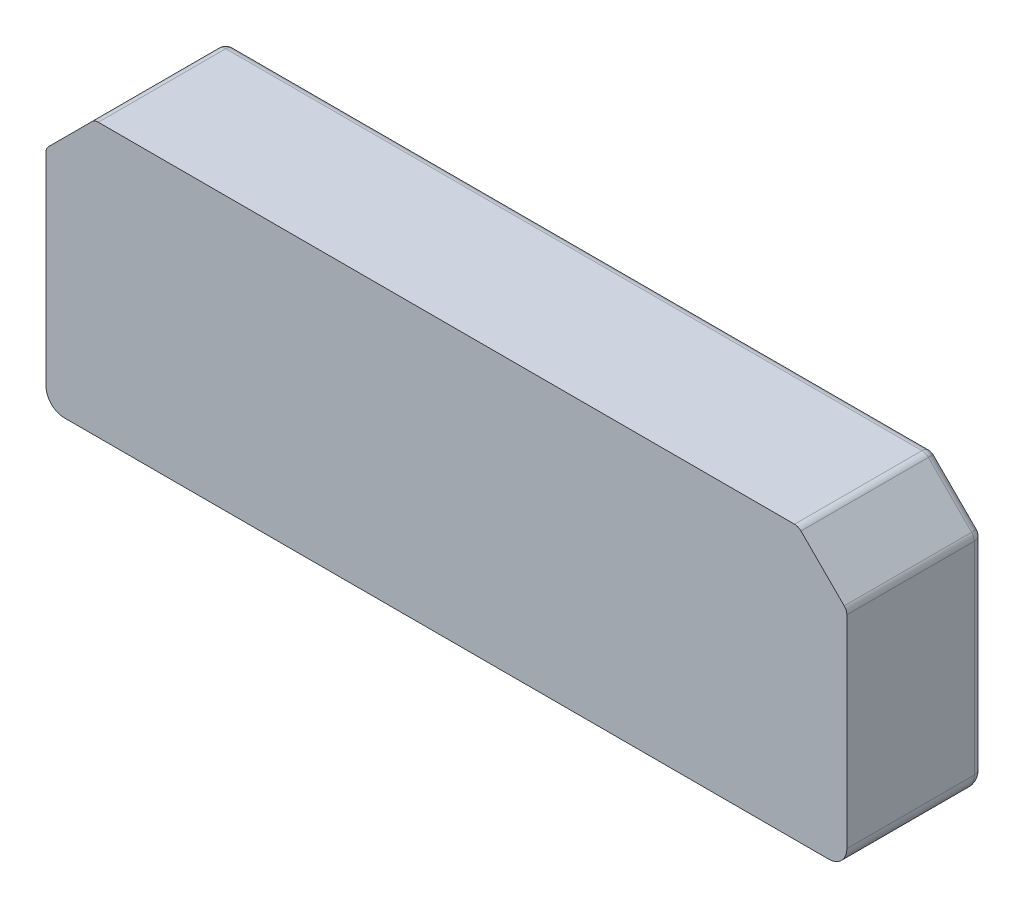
ISO-10303-21;
HEADER;
FILE_DESCRIPTION(('STEP AP214'),'2;1');
FILE_NAME('part.step','',(''),(''),'','','');
FILE_SCHEMA(('AUTOMOTIVE_DESIGN { 1 0 10303 214 1 1 1 1 }'));
ENDSEC;
DATA;
#1=APPLICATION_CONTEXT('core data for automotive mechanical design processes');
#2=APPLICATION_PROTOCOL_DEFINITION('international standard','automotive_design',2000,#1);
#3=PRODUCT_CONTEXT('',#1,'mechanical');
#4=PRODUCT('Part','Part','',(#3));
#5=PRODUCT_RELATED_PRODUCT_CATEGORY('part','',(#4));
#6=PRODUCT_DEFINITION_FORMATION('','',#4);
#7=PRODUCT_DEFINITION_CONTEXT('part definition',#1,'design');
#8=PRODUCT_DEFINITION('design','',#6,#7);
#9=PRODUCT_DEFINITION_SHAPE('','',#8);
#10=(LENGTH_UNIT() NAMED_UNIT(*) SI_UNIT(.MILLI.,.METRE.));
#11=(NAMED_UNIT(*) PLANE_ANGLE_UNIT() SI_UNIT($,.RADIAN.));
#12=(NAMED_UNIT(*) SI_UNIT($,.STERADIAN.) SOLID_ANGLE_UNIT());
#13=UNCERTAINTY_MEASURE_WITH_UNIT(LENGTH_MEASURE(1.E-05),#10,'distance_accuracy_value','');
#14=(GEOMETRIC_REPRESENTATION_CONTEXT(3) GLOBAL_UNCERTAINTY_ASSIGNED_CONTEXT((#13)) GLOBAL_UNIT_ASSIGNED_CONTEXT((#10,
#11,#12)) REPRESENTATION_CONTEXT('',''));
#15=CARTESIAN_POINT('',(0.,0.,0.));
#16=DIRECTION('',(0.,0.,1.));
#17=DIRECTION('',(1.,0.,0.));
#18=AXIS2_PLACEMENT_3D('',#15,#16,#17);
#19=CARTESIAN_POINT('',(-126.000000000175,6.,45.));
#20=DIRECTION('',(0.,0.,-1.));
#21=DIRECTION('',(-1.,0.,0.));
#22=AXIS2_PLACEMENT_3D('',#19,#20,#21);
#23=CYLINDRICAL_SURFACE('',#22,6.);
#24=DIRECTION('',(0.,0.,-1.));
#25=VECTOR('',#24,1.);
#26=CARTESIAN_POINT('',(-132.000000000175,6.,45.));
#27=LINE('',#26,#25);
#28=CARTESIAN_POINT('',(-132.000000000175,6.,45.));
#29=VERTEX_POINT('',#28);
#30=CARTESIAN_POINT('',(-132.000000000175,6.,3.));
#31=VERTEX_POINT('',#30);
#32=EDGE_CURVE('E276',#29,#31,#27,.T.);
#33=ORIENTED_EDGE('',*,*,#32,.T.);
#34=CARTESIAN_POINT('',(-126.000000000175,6.,2.99999999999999));
#35=DIRECTION('',(0.,0.,1.));
#36=DIRECTION('',(1.,0.,0.));
#37=AXIS2_PLACEMENT_3D('',#34,#35,#36);
#38=CIRCLE('',#37,6.);
#39=CARTESIAN_POINT('',(-125.999999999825,0.,3.));
#40=VERTEX_POINT('',#39);
#41=EDGE_CURVE('E11',#31,#40,#38,.T.);
#42=ORIENTED_EDGE('',*,*,#41,.T.);
#43=DIRECTION('',(0.,0.,-1.));
#44=VECTOR('',#43,1.);
#45=CARTESIAN_POINT('',(-125.999999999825,0.,45.));
#46=LINE('',#45,#44);
#47=CARTESIAN_POINT('',(-125.999999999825,0.,45.));
#48=VERTEX_POINT('',#47);
#49=EDGE_CURVE('E156',#48,#40,#46,.T.);
#50=ORIENTED_EDGE('',*,*,#49,.F.);
#51=CARTESIAN_POINT('',(-126.000000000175,6.,45.));
#52=DIRECTION('',(0.,0.,1.));
#53=DIRECTION('',(1.,0.,0.));
#54=AXIS2_PLACEMENT_3D('',#51,#52,#53);
#55=CIRCLE('',#54,6.);
#56=EDGE_CURVE('E163',#29,#48,#55,.T.);
#57=ORIENTED_EDGE('',*,*,#56,.F.);
#58=EDGE_LOOP('',(#33,#42,#50,#57));
#59=FACE_BOUND('',#58,.T.);
#60=ADVANCED_FACE('F35',(#59),#23,.T.);
#61=CARTESIAN_POINT('',(-125.999999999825,0.,45.));
#62=DIRECTION('',(0.,1.,0.));
#63=DIRECTION('',(0.,0.,1.));
#64=AXIS2_PLACEMENT_3D('',#61,#62,#63);
#65=PLANE('',#64);
#66=ORIENTED_EDGE('',*,*,#49,.T.);
#67=DIRECTION('',(1.,0.,0.));
#68=VECTOR('',#67,1.);
#69=CARTESIAN_POINT('',(-125.999999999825,0.,3.));
#70=LINE('',#69,#68);
#71=CARTESIAN_POINT('',(125.999999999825,0.,3.));
#72=VERTEX_POINT('',#71);
#73=EDGE_CURVE('E172',#40,#72,#70,.T.);
#74=ORIENTED_EDGE('',*,*,#73,.T.);
#75=DIRECTION('',(0.,0.,-1.));
#76=VECTOR('',#75,1.);
#77=CARTESIAN_POINT('',(125.999999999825,0.,45.));
#78=LINE('',#77,#76);
#79=CARTESIAN_POINT('',(125.999999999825,0.,45.));
#80=VERTEX_POINT('',#79);
#81=EDGE_CURVE('E159',#80,#72,#78,.T.);
#82=ORIENTED_EDGE('',*,*,#81,.F.);
#83=DIRECTION('',(1.,0.,0.));
#84=VECTOR('',#83,1.);
#85=CARTESIAN_POINT('',(-125.999999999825,0.,45.));
#86=LINE('',#85,#84);
#87=EDGE_CURVE('E151',#48,#80,#86,.T.);
#88=ORIENTED_EDGE('',*,*,#87,.F.);
#89=EDGE_LOOP('',(#66,#74,#82,#88));
#90=FACE_BOUND('',#89,.T.);
#91=ADVANCED_FACE('F153',(#90),#65,.F.);
#92=CARTESIAN_POINT('',(125.999999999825,6.,45.));
#93=DIRECTION('',(0.,0.,-1.));
#94=DIRECTION('',(-1.,0.,0.));
#95=AXIS2_PLACEMENT_3D('',#92,#93,#94);
#96=CYLINDRICAL_SURFACE('',#95,5.99999999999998);
#97=ORIENTED_EDGE('',*,*,#81,.T.);
#98=CARTESIAN_POINT('',(125.999999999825,6.,2.99999999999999));
#99=DIRECTION('',(0.,0.,1.));
#100=DIRECTION('',(1.,0.,0.));
#101=AXIS2_PLACEMENT_3D('',#98,#99,#100);
#102=CIRCLE('',#101,5.99999999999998);
#103=CARTESIAN_POINT('',(131.999999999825,6.000000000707,3.00000000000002));
#104=VERTEX_POINT('',#103);
#105=EDGE_CURVE('E196',#72,#104,#102,.T.);
#106=ORIENTED_EDGE('',*,*,#105,.T.);
#107=DIRECTION('',(0.,0.,-1.));
#108=VECTOR('',#107,1.);
#109=CARTESIAN_POINT('',(131.999999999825,6.000000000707,45.));
#110=LINE('',#109,#108);
#111=CARTESIAN_POINT('',(131.999999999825,6.000000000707,45.));
#112=VERTEX_POINT('',#111);
#113=EDGE_CURVE('E176',#112,#104,#110,.T.);
#114=ORIENTED_EDGE('',*,*,#113,.F.);
#115=CARTESIAN_POINT('',(125.999999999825,6.,45.));
#116=DIRECTION('',(0.,0.,1.));
#117=DIRECTION('',(1.,0.,0.));
#118=AXIS2_PLACEMENT_3D('',#115,#116,#117);
#119=CIRCLE('',#118,5.99999999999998);
#120=EDGE_CURVE('E162',#80,#112,#119,.T.);
#121=ORIENTED_EDGE('',*,*,#120,.F.);
#122=EDGE_LOOP('',(#97,#106,#114,#121));
#123=FACE_BOUND('',#122,.T.);
#124=ADVANCED_FACE('F345',(#123),#96,.T.);
#125=CARTESIAN_POINT('',(131.999999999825,6.000000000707,45.));
#126=DIRECTION('',(-1.,0.,0.));
#127=DIRECTION('',(0.,0.,1.));
#128=AXIS2_PLACEMENT_3D('',#125,#126,#127);
#129=PLANE('',#128);
#130=ORIENTED_EDGE('',*,*,#113,.T.);
#131=DIRECTION('',(0.,1.,0.));
#132=VECTOR('',#131,1.);
#133=CARTESIAN_POINT('',(131.999999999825,6.000000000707,3.));
#134=LINE('',#133,#132);
#135=CARTESIAN_POINT('',(131.999999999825,72.75735931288,3.00000000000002));
#136=VERTEX_POINT('',#135);
#137=EDGE_CURVE('E198',#104,#136,#134,.T.);
#138=ORIENTED_EDGE('',*,*,#137,.T.);
#139=DIRECTION('',(0.,0.,-1.));
#140=VECTOR('',#139,1.);
#141=CARTESIAN_POINT('',(131.999999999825,72.75735931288,45.));
#142=LINE('',#141,#140);
#143=CARTESIAN_POINT('',(131.999999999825,72.75735931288,45.));
#144=VERTEX_POINT('',#143);
#145=EDGE_CURVE('E291',#144,#136,#142,.T.);
#146=ORIENTED_EDGE('',*,*,#145,.F.);
#147=DIRECTION('',(0.,1.,0.));
#148=VECTOR('',#147,1.);
#149=CARTESIAN_POINT('',(131.999999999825,6.000000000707,45.));
#150=LINE('',#149,#148);
#151=EDGE_CURVE('E300',#112,#144,#150,.T.);
#152=ORIENTED_EDGE('',*,*,#151,.F.);
#153=EDGE_LOOP('',(#130,#138,#146,#152));
#154=FACE_BOUND('',#153,.T.);
#155=ADVANCED_FACE('F298',(#154),#129,.F.);
#156=CARTESIAN_POINT('',(128.99999999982,72.7573593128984,45.));
#157=DIRECTION('',(0.,0.,-1.));
#158=DIRECTION('',(-1.,0.,0.));
#159=AXIS2_PLACEMENT_3D('',#156,#157,#158);
#160=CYLINDRICAL_SURFACE('',#159,3.00000000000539);
#161=ORIENTED_EDGE('',*,*,#145,.T.);
#162=CARTESIAN_POINT('',(128.99999999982,72.7573593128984,3.00000000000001));
#163=DIRECTION('',(0.,0.,-1.));
#164=DIRECTION('',(-1.,0.,0.));
#165=AXIS2_PLACEMENT_3D('',#162,#163,#164);
#166=CIRCLE('',#165,3.00000000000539);
#167=CARTESIAN_POINT('',(131.121320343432,74.8786796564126,3.00000000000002));
#168=VERTEX_POINT('',#167);
#169=EDGE_CURVE('E200',#136,#168,#166,.F.);
#170=ORIENTED_EDGE('',*,*,#169,.T.);
#171=DIRECTION('',(0.,0.,-1.));
#172=VECTOR('',#171,1.);
#173=CARTESIAN_POINT('',(131.121320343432,74.8786796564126,45.));
#174=LINE('',#173,#172);
#175=CARTESIAN_POINT('',(131.121320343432,74.8786796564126,45.));
#176=VERTEX_POINT('',#175);
#177=EDGE_CURVE('E288',#176,#168,#174,.T.);
#178=ORIENTED_EDGE('',*,*,#177,.F.);
#179=CARTESIAN_POINT('',(128.99999999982,72.7573593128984,45.));
#180=DIRECTION('',(0.,0.,1.));
#181=DIRECTION('',(1.,0.,0.));
#182=AXIS2_PLACEMENT_3D('',#179,#180,#181);
#183=CIRCLE('',#182,3.00000000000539);
#184=EDGE_CURVE('E552',#144,#176,#183,.T.);
#185=ORIENTED_EDGE('',*,*,#184,.F.);
#186=EDGE_LOOP('',(#161,#170,#178,#185));
#187=FACE_BOUND('',#186,.T.);
#188=ADVANCED_FACE('F500',(#187),#160,.T.);
#189=CARTESIAN_POINT('',(131.121320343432,74.8786796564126,45.));
#190=DIRECTION('',(-0.707106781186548,-0.707106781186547,0.));
#191=DIRECTION('',(0.707106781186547,-0.707106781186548,0.));
#192=AXIS2_PLACEMENT_3D('',#189,#190,#191);
#193=PLANE('',#192);
#194=ORIENTED_EDGE('',*,*,#177,.T.);
#195=DIRECTION('',(-0.707106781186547,0.707106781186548,0.));
#196=VECTOR('',#195,1.);
#197=CARTESIAN_POINT('',(131.121320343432,74.8786796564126,3.));
#198=LINE('',#197,#196);
#199=CARTESIAN_POINT('',(116.878679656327,89.1213203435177,3.00000000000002));
#200=VERTEX_POINT('',#199);
#201=EDGE_CURVE('E202',#168,#200,#198,.T.);
#202=ORIENTED_EDGE('',*,*,#201,.T.);
#203=DIRECTION('',(0.,0.,-1.));
#204=VECTOR('',#203,1.);
#205=CARTESIAN_POINT('',(116.878679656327,89.1213203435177,45.));
#206=LINE('',#205,#204);
#207=CARTESIAN_POINT('',(116.878679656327,89.1213203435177,45.));
#208=VERTEX_POINT('',#207);
#209=EDGE_CURVE('E285',#208,#200,#206,.T.);
#210=ORIENTED_EDGE('',*,*,#209,.F.);
#211=DIRECTION('',(-0.707106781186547,0.707106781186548,0.));
#212=VECTOR('',#211,1.);
#213=CARTESIAN_POINT('',(131.121320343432,74.8786796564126,45.));
#214=LINE('',#213,#212);
#215=EDGE_CURVE('E556',#176,#208,#214,.T.);
#216=ORIENTED_EDGE('',*,*,#215,.F.);
#217=EDGE_LOOP('',(#194,#202,#210,#216));
#218=FACE_BOUND('',#217,.T.);
#219=ADVANCED_FACE('F491',(#218),#193,.F.);
#220=CARTESIAN_POINT('',(114.757359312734,86.9999999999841,45.));
#221=DIRECTION('',(0.,0.,-1.));
#222=DIRECTION('',(-1.,0.,0.));
#223=AXIS2_PLACEMENT_3D('',#220,#221,#222);
#224=CYLINDRICAL_SURFACE('',#223,3.00000000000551);
#225=ORIENTED_EDGE('',*,*,#209,.T.);
#226=CARTESIAN_POINT('',(114.757359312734,86.9999999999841,3.00000000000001));
#227=DIRECTION('',(0.,0.,-1.));
#228=DIRECTION('',(-1.,0.,0.));
#229=AXIS2_PLACEMENT_3D('',#226,#227,#228);
#230=CIRCLE('',#229,3.00000000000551);
#231=CARTESIAN_POINT('',(114.757359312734,89.9999999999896,3.00000000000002));
#232=VERTEX_POINT('',#231);
#233=EDGE_CURVE('E204',#200,#232,#230,.F.);
#234=ORIENTED_EDGE('',*,*,#233,.T.);
#235=DIRECTION('',(0.,0.,-1.));
#236=VECTOR('',#235,1.);
#237=CARTESIAN_POINT('',(114.757359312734,89.9999999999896,45.));
#238=LINE('',#237,#236);
#239=CARTESIAN_POINT('',(114.757359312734,89.9999999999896,45.));
#240=VERTEX_POINT('',#239);
#241=EDGE_CURVE('E282',#240,#232,#238,.T.);
#242=ORIENTED_EDGE('',*,*,#241,.F.);
#243=CARTESIAN_POINT('',(114.757359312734,86.9999999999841,45.));
#244=DIRECTION('',(0.,0.,1.));
#245=DIRECTION('',(1.,0.,0.));
#246=AXIS2_PLACEMENT_3D('',#243,#244,#245);
#247=CIRCLE('',#246,3.00000000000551);
#248=EDGE_CURVE('E558',#208,#240,#247,.T.);
#249=ORIENTED_EDGE('',*,*,#248,.F.);
#250=EDGE_LOOP('',(#225,#234,#242,#249));
#251=FACE_BOUND('',#250,.T.);
#252=ADVANCED_FACE('F482',(#251),#224,.T.);
#253=CARTESIAN_POINT('',(114.757359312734,89.9999999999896,45.));
#254=DIRECTION('',(0.,-1.,0.));
#255=DIRECTION('',(0.,0.,-1.));
#256=AXIS2_PLACEMENT_3D('',#253,#254,#255);
#257=PLANE('',#256);
#258=ORIENTED_EDGE('',*,*,#241,.T.);
#259=DIRECTION('',(-1.,0.,0.));
#260=VECTOR('',#259,1.);
#261=CARTESIAN_POINT('',(114.757359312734,89.9999999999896,3.));
#262=LINE('',#261,#260);
#263=CARTESIAN_POINT('',(-114.757359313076,89.9999999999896,3.00000000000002));
#264=VERTEX_POINT('',#263);
#265=EDGE_CURVE('E206',#232,#264,#262,.T.);
#266=ORIENTED_EDGE('',*,*,#265,.T.);
#267=DIRECTION('',(0.,0.,-1.));
#268=VECTOR('',#267,1.);
#269=CARTESIAN_POINT('',(-114.757359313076,89.9999999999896,45.));
#270=LINE('',#269,#268);
#271=CARTESIAN_POINT('',(-114.757359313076,89.9999999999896,45.));
#272=VERTEX_POINT('',#271);
#273=EDGE_CURVE('E274',#272,#264,#270,.T.);
#274=ORIENTED_EDGE('',*,*,#273,.F.);
#275=DIRECTION('',(-1.,0.,0.));
#276=VECTOR('',#275,1.);
#277=CARTESIAN_POINT('',(114.757359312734,89.9999999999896,45.));
#278=LINE('',#277,#276);
#279=EDGE_CURVE('E560',#240,#272,#278,.T.);
#280=ORIENTED_EDGE('',*,*,#279,.F.);
#281=EDGE_LOOP('',(#258,#266,#274,#280));
#282=FACE_BOUND('',#281,.T.);
#283=ADVANCED_FACE('F473',(#282),#257,.F.);
#284=CARTESIAN_POINT('',(-114.757359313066,86.9999999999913,45.));
#285=DIRECTION('',(0.,0.,-1.));
#286=DIRECTION('',(-1.,0.,0.));
#287=AXIS2_PLACEMENT_3D('',#284,#285,#286);
#288=CYLINDRICAL_SURFACE('',#287,2.99999999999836);
#289=ORIENTED_EDGE('',*,*,#273,.T.);
#290=CARTESIAN_POINT('',(-114.757359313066,86.9999999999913,3.00000000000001));
#291=DIRECTION('',(0.,0.,-1.));
#292=DIRECTION('',(-1.,0.,0.));
#293=AXIS2_PLACEMENT_3D('',#290,#291,#292);
#294=CIRCLE('',#293,2.99999999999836);
#295=CARTESIAN_POINT('',(-116.87867965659,89.1213203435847,3.00000000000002));
#296=VERTEX_POINT('',#295);
#297=EDGE_CURVE('E208',#264,#296,#294,.F.);
#298=ORIENTED_EDGE('',*,*,#297,.T.);
#299=DIRECTION('',(0.,0.,-1.));
#300=VECTOR('',#299,1.);
#301=CARTESIAN_POINT('',(-116.87867965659,89.1213203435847,45.));
#302=LINE('',#301,#300);
#303=CARTESIAN_POINT('',(-116.87867965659,89.1213203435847,45.));
#304=VERTEX_POINT('',#303);
#305=EDGE_CURVE('E269',#304,#296,#302,.T.);
#306=ORIENTED_EDGE('',*,*,#305,.F.);
#307=CARTESIAN_POINT('',(-114.757359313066,86.9999999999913,45.));
#308=DIRECTION('',(0.,0.,1.));
#309=DIRECTION('',(1.,0.,0.));
#310=AXIS2_PLACEMENT_3D('',#307,#308,#309);
#311=CIRCLE('',#310,2.99999999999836);
#312=EDGE_CURVE('E562',#272,#304,#311,.T.);
#313=ORIENTED_EDGE('',*,*,#312,.F.);
#314=EDGE_LOOP('',(#289,#298,#306,#313));
#315=FACE_BOUND('',#314,.T.);
#316=ADVANCED_FACE('F465',(#315),#288,.T.);
#317=CARTESIAN_POINT('',(-116.87867965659,89.1213203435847,45.));
#318=DIRECTION('',(0.707106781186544,-0.707106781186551,0.));
#319=DIRECTION('',(0.707106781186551,0.707106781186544,0.));
#320=AXIS2_PLACEMENT_3D('',#317,#318,#319);
#321=PLANE('',#320);
#322=ORIENTED_EDGE('',*,*,#305,.T.);
#323=DIRECTION('',(-0.707106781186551,-0.707106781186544,0.));
#324=VECTOR('',#323,1.);
#325=CARTESIAN_POINT('',(-116.87867965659,89.1213203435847,3.));
#326=LINE('',#325,#324);
#327=CARTESIAN_POINT('',(-131.121320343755,74.8786796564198,3.00000000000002));
#328=VERTEX_POINT('',#327);
#329=EDGE_CURVE('E210',#296,#328,#326,.T.);
#330=ORIENTED_EDGE('',*,*,#329,.T.);
#331=DIRECTION('',(0.,0.,-1.));
#332=VECTOR('',#331,1.);
#333=CARTESIAN_POINT('',(-131.121320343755,74.8786796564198,45.));
#334=LINE('',#333,#332);
#335=CARTESIAN_POINT('',(-131.121320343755,74.8786796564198,45.));
#336=VERTEX_POINT('',#335);
#337=EDGE_CURVE('E266',#336,#328,#334,.T.);
#338=ORIENTED_EDGE('',*,*,#337,.F.);
#339=DIRECTION('',(-0.707106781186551,-0.707106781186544,0.));
#340=VECTOR('',#339,1.);
#341=CARTESIAN_POINT('',(-116.87867965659,89.1213203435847,45.));
#342=LINE('',#341,#340);
#343=EDGE_CURVE('E564',#304,#336,#342,.T.);
#344=ORIENTED_EDGE('',*,*,#343,.F.);
#345=EDGE_LOOP('',(#322,#330,#338,#344));
#346=FACE_BOUND('',#345,.T.);
#347=ADVANCED_FACE('F264',(#346),#321,.F.);
#348=CARTESIAN_POINT('',(-129.000000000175,72.75735931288,45.));
#349=DIRECTION('',(0.,0.,-1.));
#350=DIRECTION('',(-1.,0.,0.));
#351=AXIS2_PLACEMENT_3D('',#348,#349,#350);
#352=CYLINDRICAL_SURFACE('',#351,3.00000000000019);
#353=ORIENTED_EDGE('',*,*,#337,.T.);
#354=CARTESIAN_POINT('',(-129.000000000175,72.75735931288,3.00000000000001));
#355=DIRECTION('',(0.,0.,-1.));
#356=DIRECTION('',(-1.,0.,0.));
#357=AXIS2_PLACEMENT_3D('',#354,#355,#356);
#358=CIRCLE('',#357,3.00000000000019);
#359=CARTESIAN_POINT('',(-132.000000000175,72.75735931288,3.00000000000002));
#360=VERTEX_POINT('',#359);
#361=EDGE_CURVE('E59',#328,#360,#358,.F.);
#362=ORIENTED_EDGE('',*,*,#361,.T.);
#363=DIRECTION('',(0.,0.,-1.));
#364=VECTOR('',#363,1.);
#365=CARTESIAN_POINT('',(-132.000000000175,72.75735931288,45.));
#366=LINE('',#365,#364);
#367=CARTESIAN_POINT('',(-132.000000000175,72.75735931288,45.));
#368=VERTEX_POINT('',#367);
#369=EDGE_CURVE('E272',#368,#360,#366,.T.);
#370=ORIENTED_EDGE('',*,*,#369,.F.);
#371=CARTESIAN_POINT('',(-129.000000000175,72.75735931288,45.));
#372=DIRECTION('',(0.,0.,1.));
#373=DIRECTION('',(1.,0.,0.));
#374=AXIS2_PLACEMENT_3D('',#371,#372,#373);
#375=CIRCLE('',#374,3.00000000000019);
#376=EDGE_CURVE('E271',#336,#368,#375,.T.);
#377=ORIENTED_EDGE('',*,*,#376,.F.);
#378=EDGE_LOOP('',(#353,#362,#370,#377));
#379=FACE_BOUND('',#378,.T.);
#380=ADVANCED_FACE('F270',(#379),#352,.T.);
#381=CARTESIAN_POINT('',(-132.000000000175,72.75735931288,45.));
#382=DIRECTION('',(1.,0.,0.));
#383=DIRECTION('',(0.,1.,0.));
#384=AXIS2_PLACEMENT_3D('',#381,#382,#383);
#385=PLANE('',#384);
#386=ORIENTED_EDGE('',*,*,#369,.T.);
#387=DIRECTION('',(0.,-1.,0.));
#388=VECTOR('',#387,1.);
#389=CARTESIAN_POINT('',(-132.000000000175,72.75735931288,3.));
#390=LINE('',#389,#388);
#391=EDGE_CURVE('E44',#360,#31,#390,.T.);
#392=ORIENTED_EDGE('',*,*,#391,.T.);
#393=ORIENTED_EDGE('',*,*,#32,.F.);
#394=DIRECTION('',(0.,-1.,0.));
#395=VECTOR('',#394,1.);
#396=CARTESIAN_POINT('',(-132.000000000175,72.75735931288,45.));
#397=LINE('',#396,#395);
#398=EDGE_CURVE('E168',#368,#29,#397,.T.);
#399=ORIENTED_EDGE('',*,*,#398,.F.);
#400=EDGE_LOOP('',(#386,#392,#393,#399));
#401=FACE_BOUND('',#400,.T.);
#402=ADVANCED_FACE('F444',(#401),#385,.F.);
#403=CARTESIAN_POINT('',(-126.000000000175,6.,45.));
#404=DIRECTION('',(0.,0.,1.));
#405=DIRECTION('',(1.,0.,0.));
#406=AXIS2_PLACEMENT_3D('',#403,#404,#405);
#407=PLANE('',#406);
#408=ORIENTED_EDGE('',*,*,#56,.T.);
#409=ORIENTED_EDGE('',*,*,#87,.T.);
#410=ORIENTED_EDGE('',*,*,#120,.T.);
#411=ORIENTED_EDGE('',*,*,#151,.T.);
#412=ORIENTED_EDGE('',*,*,#184,.T.);
#413=ORIENTED_EDGE('',*,*,#215,.T.);
#414=ORIENTED_EDGE('',*,*,#248,.T.);
#415=ORIENTED_EDGE('',*,*,#279,.T.);
#416=ORIENTED_EDGE('',*,*,#312,.T.);
#417=ORIENTED_EDGE('',*,*,#343,.T.);
#418=ORIENTED_EDGE('',*,*,#376,.T.);
#419=ORIENTED_EDGE('',*,*,#398,.T.);
#420=EDGE_LOOP('',(#408,#409,#410,#411,#412,#413,#414,#415,#416,#417,#418,#419));
#421=FACE_BOUND('',#420,.T.);
#422=ADVANCED_FACE('F166',(#421),#407,.T.);
#423=CARTESIAN_POINT('',(-126.000000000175,6.,0.));
#424=DIRECTION('',(0.,0.,1.));
#425=DIRECTION('',(1.,0.,0.));
#426=AXIS2_PLACEMENT_3D('',#423,#424,#425);
#427=PLANE('',#426);
#428=CARTESIAN_POINT('',(125.999999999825,6.,0.));
#429=DIRECTION('',(0.,0.,1.));
#430=DIRECTION('',(1.,0.,0.));
#431=AXIS2_PLACEMENT_3D('',#428,#429,#430);
#432=CIRCLE('',#431,2.99999999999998);
#433=CARTESIAN_POINT('',(128.999999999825,6.0000000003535,0.));
#434=VERTEX_POINT('',#433);
#435=CARTESIAN_POINT('',(125.999999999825,3.00000000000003,0.));
#436=VERTEX_POINT('',#435);
#437=EDGE_CURVE('E191',#434,#436,#432,.F.);
#438=ORIENTED_EDGE('',*,*,#437,.T.);
#439=DIRECTION('',(1.,0.,0.));
#440=VECTOR('',#439,1.);
#441=CARTESIAN_POINT('',(-126.000000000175,3.,0.));
#442=LINE('',#441,#440);
#443=CARTESIAN_POINT('',(-125.999999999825,3.,0.));
#444=VERTEX_POINT('',#443);
#445=EDGE_CURVE('E193',#436,#444,#442,.F.);
#446=ORIENTED_EDGE('',*,*,#445,.T.);
#447=CARTESIAN_POINT('',(-126.000000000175,6.,0.));
#448=DIRECTION('',(0.,0.,1.));
#449=DIRECTION('',(1.,0.,0.));
#450=AXIS2_PLACEMENT_3D('',#447,#448,#449);
#451=CIRCLE('',#450,3.);
#452=CARTESIAN_POINT('',(-129.000000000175,6.00000000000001,0.));
#453=VERTEX_POINT('',#452);
#454=EDGE_CURVE('E174',#444,#453,#451,.F.);
#455=ORIENTED_EDGE('',*,*,#454,.T.);
#456=DIRECTION('',(0.,-1.,0.));
#457=VECTOR('',#456,1.);
#458=CARTESIAN_POINT('',(-129.000000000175,5.99999999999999,0.));
#459=LINE('',#458,#457);
#460=CARTESIAN_POINT('',(-129.000000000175,72.75735931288,0.));
#461=VERTEX_POINT('',#460);
#462=EDGE_CURVE('E181',#453,#461,#459,.F.);
#463=ORIENTED_EDGE('',*,*,#462,.T.);
#464=DIRECTION('',(-0.707106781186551,-0.707106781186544,0.));
#465=VECTOR('',#464,1.);
#466=CARTESIAN_POINT('',(-160.878679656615,40.8786796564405,0.));
#467=LINE('',#466,#465);
#468=CARTESIAN_POINT('',(-114.757359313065,86.9999999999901,0.));
#469=VERTEX_POINT('',#468);
#470=EDGE_CURVE('E183',#461,#469,#467,.F.);
#471=ORIENTED_EDGE('',*,*,#470,.T.);
#472=DIRECTION('',(-1.,0.,0.));
#473=VECTOR('',#472,1.);
#474=CARTESIAN_POINT('',(-126.000000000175,86.9999999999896,0.));
#475=LINE('',#474,#473);
#476=CARTESIAN_POINT('',(114.757359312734,86.9999999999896,0.));
#477=VERTEX_POINT('',#476);
#478=EDGE_CURVE('E185',#469,#477,#475,.F.);
#479=ORIENTED_EDGE('',*,*,#478,.T.);
#480=DIRECTION('',(-0.707106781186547,0.707106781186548,0.));
#481=VECTOR('',#480,1.);
#482=CARTESIAN_POINT('',(34.8786796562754,166.87867965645,0.));
#483=LINE('',#482,#481);
#484=CARTESIAN_POINT('',(128.999999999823,72.7573593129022,0.));
#485=VERTEX_POINT('',#484);
#486=EDGE_CURVE('E187',#477,#485,#483,.F.);
#487=ORIENTED_EDGE('',*,*,#486,.T.);
#488=DIRECTION('',(0.,1.,0.));
#489=VECTOR('',#488,1.);
#490=CARTESIAN_POINT('',(128.999999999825,6.,0.));
#491=LINE('',#490,#489);
#492=EDGE_CURVE('E189',#485,#434,#491,.F.);
#493=ORIENTED_EDGE('',*,*,#492,.T.);
#494=EDGE_LOOP('',(#438,#446,#455,#463,#471,#479,#487,#493));
#495=FACE_BOUND('',#494,.T.);
#496=ADVANCED_FACE('F314',(#495),#427,.F.);
#497=CARTESIAN_POINT('',(114.757359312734,86.9999999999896,3.));
#498=DIRECTION('',(-1.,0.,0.));
#499=DIRECTION('',(0.,0.,1.));
#500=AXIS2_PLACEMENT_3D('',#497,#498,#499);
#501=CYLINDRICAL_SURFACE('',#500,3.);
#502=CARTESIAN_POINT('',(-114.757359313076,86.9999999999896,3.));
#503=DIRECTION('',(-1.,0.,0.));
#504=DIRECTION('',(0.,0.,1.));
#505=AXIS2_PLACEMENT_3D('',#502,#503,#504);
#506=CIRCLE('',#505,3.);
#507=EDGE_CURVE('E39',#264,#469,#506,.T.);
#508=ORIENTED_EDGE('',*,*,#507,.F.);
#509=ORIENTED_EDGE('',*,*,#265,.F.);
#510=CARTESIAN_POINT('',(114.757359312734,86.9999999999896,3.));
#511=DIRECTION('',(1.,0.,0.));
#512=DIRECTION('',(0.,0.,-1.));
#513=AXIS2_PLACEMENT_3D('',#510,#511,#512);
#514=CIRCLE('',#513,3.);
#515=EDGE_CURVE('E241',#477,#232,#514,.T.);
#516=ORIENTED_EDGE('',*,*,#515,.F.);
#517=ORIENTED_EDGE('',*,*,#478,.F.);
#518=EDGE_LOOP('',(#508,#509,#516,#517));
#519=FACE_BOUND('',#518,.T.);
#520=ADVANCED_FACE('F37',(#519),#501,.T.);
#521=CARTESIAN_POINT('',(-114.757359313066,86.9999999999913,3.));
#522=DIRECTION('',(0.,0.,1.));
#523=DIRECTION('',(1.,0.,0.));
#524=AXIS2_PLACEMENT_3D('',#521,#522,#523);
#525=SPHERICAL_SURFACE('',#524,3.);
#526=ORIENTED_EDGE('',*,*,#297,.F.);
#527=ORIENTED_EDGE('',*,*,#507,.T.);
#528=CARTESIAN_POINT('',(-114.757359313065,86.9999999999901,3.00000000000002));
#529=DIRECTION('',(-0.707106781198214,-0.707106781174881,0.));
#530=DIRECTION('',(0.707106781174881,-0.707106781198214,0.));
#531=AXIS2_PLACEMENT_3D('',#528,#529,#530);
#532=CIRCLE('',#531,3.);
#533=EDGE_CURVE('E239',#296,#469,#532,.T.);
#534=ORIENTED_EDGE('',*,*,#533,.F.);
#535=EDGE_LOOP('',(#526,#527,#534));
#536=FACE_BOUND('',#535,.T.);
#537=ADVANCED_FACE('F252',(#536),#525,.T.);
#538=CARTESIAN_POINT('',(114.757359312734,86.9999999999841,3.));
#539=DIRECTION('',(0.,0.,1.));
#540=DIRECTION('',(1.,0.,0.));
#541=AXIS2_PLACEMENT_3D('',#538,#539,#540);
#542=SPHERICAL_SURFACE('',#541,3.);
#543=ORIENTED_EDGE('',*,*,#515,.T.);
#544=ORIENTED_EDGE('',*,*,#233,.F.);
#545=CARTESIAN_POINT('',(114.757359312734,86.9999999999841,3.));
#546=DIRECTION('',(0.707106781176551,-0.707106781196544,0.));
#547=DIRECTION('',(0.707106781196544,0.707106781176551,0.));
#548=AXIS2_PLACEMENT_3D('',#545,#546,#547);
#549=CIRCLE('',#548,3.);
#550=EDGE_CURVE('E236',#477,#200,#549,.T.);
#551=ORIENTED_EDGE('',*,*,#550,.F.);
#552=EDGE_LOOP('',(#543,#544,#551));
#553=FACE_BOUND('',#552,.T.);
#554=ADVANCED_FACE('F409',(#553),#542,.T.);
#555=CARTESIAN_POINT('',(-114.75735931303,87.0000000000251,3.));
#556=DIRECTION('',(-0.707106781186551,-0.707106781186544,0.));
#557=DIRECTION('',(0.707106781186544,-0.707106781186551,0.));
#558=AXIS2_PLACEMENT_3D('',#555,#556,#557);
#559=CYLINDRICAL_SURFACE('',#558,3.);
#560=ORIENTED_EDGE('',*,*,#533,.T.);
#561=ORIENTED_EDGE('',*,*,#470,.F.);
#562=CARTESIAN_POINT('',(-129.000000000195,72.7573593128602,3.));
#563=DIRECTION('',(-0.70710678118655,-0.707106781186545,0.));
#564=DIRECTION('',(0.707106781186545,-0.70710678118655,0.));
#565=AXIS2_PLACEMENT_3D('',#562,#563,#564);
#566=CIRCLE('',#565,3.);
#567=EDGE_CURVE('E233',#328,#461,#566,.T.);
#568=ORIENTED_EDGE('',*,*,#567,.F.);
#569=ORIENTED_EDGE('',*,*,#329,.F.);
#570=EDGE_LOOP('',(#560,#561,#568,#569));
#571=FACE_BOUND('',#570,.T.);
#572=ADVANCED_FACE('F259',(#571),#559,.T.);
#573=CARTESIAN_POINT('',(128.999999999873,72.757359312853,3.));
#574=DIRECTION('',(-0.707106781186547,0.707106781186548,0.));
#575=DIRECTION('',(-0.707106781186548,-0.707106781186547,0.));
#576=AXIS2_PLACEMENT_3D('',#573,#574,#575);
#577=CYLINDRICAL_SURFACE('',#576,3.);
#578=ORIENTED_EDGE('',*,*,#550,.T.);
#579=ORIENTED_EDGE('',*,*,#201,.F.);
#580=CARTESIAN_POINT('',(128.999999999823,72.7573593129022,3.));
#581=DIRECTION('',(0.707106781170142,-0.707106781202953,0.));
#582=DIRECTION('',(0.707106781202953,0.707106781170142,0.));
#583=AXIS2_PLACEMENT_3D('',#580,#581,#582);
#584=CIRCLE('',#583,3.);
#585=EDGE_CURVE('E230',#485,#168,#584,.T.);
#586=ORIENTED_EDGE('',*,*,#585,.F.);
#587=ORIENTED_EDGE('',*,*,#486,.F.);
#588=EDGE_LOOP('',(#578,#579,#586,#587));
#589=FACE_BOUND('',#588,.T.);
#590=ADVANCED_FACE('F330',(#589),#577,.T.);
#591=CARTESIAN_POINT('',(-129.000000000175,72.75735931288,3.));
#592=DIRECTION('',(0.,0.,1.));
#593=DIRECTION('',(1.,0.,0.));
#594=AXIS2_PLACEMENT_3D('',#591,#592,#593);
#595=SPHERICAL_SURFACE('',#594,3.);
#596=ORIENTED_EDGE('',*,*,#361,.F.);
#597=ORIENTED_EDGE('',*,*,#567,.T.);
#598=CARTESIAN_POINT('',(-129.000000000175,72.75735931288,3.00000000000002));
#599=DIRECTION('',(0.,-1.,0.));
#600=DIRECTION('',(0.,0.,-1.));
#601=AXIS2_PLACEMENT_3D('',#598,#599,#600);
#602=CIRCLE('',#601,3.);
#603=EDGE_CURVE('E227',#360,#461,#602,.T.);
#604=ORIENTED_EDGE('',*,*,#603,.F.);
#605=EDGE_LOOP('',(#596,#597,#604));
#606=FACE_BOUND('',#605,.T.);
#607=ADVANCED_FACE('F327',(#606),#595,.T.);
#608=CARTESIAN_POINT('',(128.99999999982,72.7573593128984,3.));
#609=DIRECTION('',(0.,0.,1.));
#610=DIRECTION('',(1.,0.,0.));
#611=AXIS2_PLACEMENT_3D('',#608,#609,#610);
#612=SPHERICAL_SURFACE('',#611,3.);
#613=ORIENTED_EDGE('',*,*,#585,.T.);
#614=ORIENTED_EDGE('',*,*,#169,.F.);
#615=CARTESIAN_POINT('',(128.99999999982,72.7573593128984,3.));
#616=DIRECTION('',(-6.13860814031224E-12,-1.,0.));
#617=DIRECTION('',(1.,-6.13860814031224E-12,0.));
#618=AXIS2_PLACEMENT_3D('',#615,#616,#617);
#619=CIRCLE('',#618,3.);
#620=EDGE_CURVE('E224',#485,#136,#619,.T.);
#621=ORIENTED_EDGE('',*,*,#620,.F.);
#622=EDGE_LOOP('',(#613,#614,#621));
#623=FACE_BOUND('',#622,.T.);
#624=ADVANCED_FACE('F329',(#623),#612,.T.);
#625=CARTESIAN_POINT('',(-129.000000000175,72.75735931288,3.));
#626=DIRECTION('',(0.,-1.,0.));
#627=DIRECTION('',(1.,0.,0.));
#628=AXIS2_PLACEMENT_3D('',#625,#626,#627);
#629=CYLINDRICAL_SURFACE('',#628,3.);
#630=ORIENTED_EDGE('',*,*,#603,.T.);
#631=ORIENTED_EDGE('',*,*,#462,.F.);
#632=CARTESIAN_POINT('',(-129.000000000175,6.00000000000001,3.));
#633=DIRECTION('',(0.,-1.,0.));
#634=DIRECTION('',(1.,0.,0.));
#635=AXIS2_PLACEMENT_3D('',#632,#633,#634);
#636=CIRCLE('',#635,3.);
#637=EDGE_CURVE('E221',#31,#453,#636,.T.);
#638=ORIENTED_EDGE('',*,*,#637,.F.);
#639=ORIENTED_EDGE('',*,*,#391,.F.);
#640=EDGE_LOOP('',(#630,#631,#638,#639));
#641=FACE_BOUND('',#640,.T.);
#642=ADVANCED_FACE('F324',(#641),#629,.T.);
#643=CARTESIAN_POINT('',(128.999999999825,6.000000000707,3.));
#644=DIRECTION('',(0.,1.,0.));
#645=DIRECTION('',(0.,0.,1.));
#646=AXIS2_PLACEMENT_3D('',#643,#644,#645);
#647=CYLINDRICAL_SURFACE('',#646,3.);
#648=ORIENTED_EDGE('',*,*,#620,.T.);
#649=ORIENTED_EDGE('',*,*,#137,.F.);
#650=CARTESIAN_POINT('',(128.999999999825,6.0000000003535,3.));
#651=DIRECTION('',(1.178328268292E-10,-1.,0.));
#652=DIRECTION('',(1.,1.178328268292E-10,0.));
#653=AXIS2_PLACEMENT_3D('',#650,#651,#652);
#654=CIRCLE('',#653,3.);
#655=EDGE_CURVE('E218',#434,#104,#654,.T.);
#656=ORIENTED_EDGE('',*,*,#655,.F.);
#657=ORIENTED_EDGE('',*,*,#492,.F.);
#658=EDGE_LOOP('',(#648,#649,#656,#657));
#659=FACE_BOUND('',#658,.T.);
#660=ADVANCED_FACE('F304',(#659),#647,.T.);
#661=CARTESIAN_POINT('',(-126.000000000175,6.,3.));
#662=DIRECTION('',(0.,0.,1.));
#663=DIRECTION('',(1.,0.,0.));
#664=AXIS2_PLACEMENT_3D('',#661,#662,#663);
#665=TOROIDAL_SURFACE('',#664,3.,3.);
#666=ORIENTED_EDGE('',*,*,#637,.T.);
#667=ORIENTED_EDGE('',*,*,#454,.F.);
#668=CARTESIAN_POINT('',(-126.,3.,3.));
#669=DIRECTION('',(1.,5.83329680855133E-11,5.83329680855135E-11));
#670=DIRECTION('',(5.83329680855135E-11,0.,-1.));
#671=AXIS2_PLACEMENT_3D('',#668,#669,#670);
#672=CIRCLE('',#671,3.);
#673=EDGE_CURVE('E216',#40,#444,#672,.T.);
#674=ORIENTED_EDGE('',*,*,#673,.F.);
#675=ORIENTED_EDGE('',*,*,#41,.F.);
#676=EDGE_LOOP('',(#666,#667,#674,#675));
#677=FACE_BOUND('',#676,.T.);
#678=ADVANCED_FACE('F320',(#677),#665,.T.);
#679=CARTESIAN_POINT('',(125.999999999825,6.,3.));
#680=DIRECTION('',(0.,0.,1.));
#681=DIRECTION('',(1.,0.,0.));
#682=AXIS2_PLACEMENT_3D('',#679,#680,#681);
#683=DEGENERATE_TOROIDAL_SURFACE('',#682,2.99999999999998,3.,.T.);
#684=ORIENTED_EDGE('',*,*,#655,.T.);
#685=ORIENTED_EDGE('',*,*,#105,.F.);
#686=CARTESIAN_POINT('',(125.999999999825,3.00000000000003,3.));
#687=DIRECTION('',(-1.,0.,0.));
#688=DIRECTION('',(0.,0.,1.));
#689=AXIS2_PLACEMENT_3D('',#686,#687,#688);
#690=CIRCLE('',#689,3.);
#691=EDGE_CURVE('E214',#436,#72,#690,.T.);
#692=ORIENTED_EDGE('',*,*,#691,.F.);
#693=ORIENTED_EDGE('',*,*,#437,.F.);
#694=EDGE_LOOP('',(#684,#685,#692,#693));
#695=FACE_BOUND('',#694,.T.);
#696=ADVANCED_FACE('F310',(#695),#683,.T.);
#697=CARTESIAN_POINT('',(-125.999999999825,3.,3.));
#698=DIRECTION('',(1.,0.,0.));
#699=DIRECTION('',(0.,0.,-1.));
#700=AXIS2_PLACEMENT_3D('',#697,#698,#699);
#701=CYLINDRICAL_SURFACE('',#700,3.);
#702=ORIENTED_EDGE('',*,*,#673,.T.);
#703=ORIENTED_EDGE('',*,*,#445,.F.);
#704=ORIENTED_EDGE('',*,*,#691,.T.);
#705=ORIENTED_EDGE('',*,*,#73,.F.);
#706=EDGE_LOOP('',(#702,#703,#704,#705));
#707=FACE_BOUND('',#706,.T.);
#708=ADVANCED_FACE('F316',(#707),#701,.T.);
#709=CLOSED_SHELL('',(#60,#91,#124,#155,#188,#219,#252,#283,#316,#347,#380,#402,#422,#496,#520,
#537,#554,#572,#590,#607,#624,#642,#660,#678,#696,#708));
#710=MANIFOLD_SOLID_BREP('B2',#709);
#711=ADVANCED_BREP_SHAPE_REPRESENTATION('',(#18,#710),#14);
#712=SHAPE_DEFINITION_REPRESENTATION(#9,#711);
ENDSEC;
END-ISO-10303-21;
